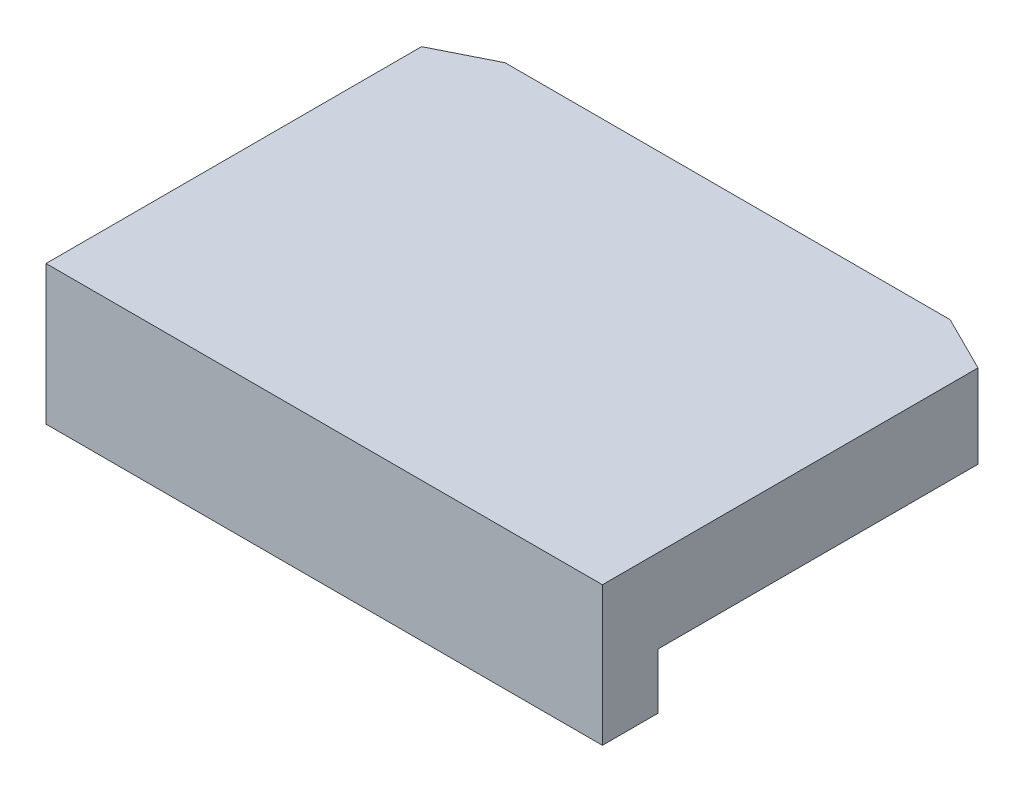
ISO-10303-21;
HEADER;
FILE_DESCRIPTION(('STEP AP214'),'2;1');
FILE_NAME('part.step','',(''),(''),'','','');
FILE_SCHEMA(('AUTOMOTIVE_DESIGN { 1 0 10303 214 1 1 1 1 }'));
ENDSEC;
DATA;
#1=APPLICATION_CONTEXT('core data for automotive mechanical design processes');
#2=APPLICATION_PROTOCOL_DEFINITION('international standard','automotive_design',2000,#1);
#3=PRODUCT_CONTEXT('',#1,'mechanical');
#4=PRODUCT('Part','Part','',(#3));
#5=PRODUCT_RELATED_PRODUCT_CATEGORY('part','',(#4));
#6=PRODUCT_DEFINITION_FORMATION('','',#4);
#7=PRODUCT_DEFINITION_CONTEXT('part definition',#1,'design');
#8=PRODUCT_DEFINITION('design','',#6,#7);
#9=PRODUCT_DEFINITION_SHAPE('','',#8);
#10=(LENGTH_UNIT() NAMED_UNIT(*) SI_UNIT(.MILLI.,.METRE.));
#11=(NAMED_UNIT(*) PLANE_ANGLE_UNIT() SI_UNIT($,.RADIAN.));
#12=(NAMED_UNIT(*) SI_UNIT($,.STERADIAN.) SOLID_ANGLE_UNIT());
#13=UNCERTAINTY_MEASURE_WITH_UNIT(LENGTH_MEASURE(1.E-05),#10,'distance_accuracy_value','');
#14=(GEOMETRIC_REPRESENTATION_CONTEXT(3) GLOBAL_UNCERTAINTY_ASSIGNED_CONTEXT((#13)) GLOBAL_UNIT_ASSIGNED_CONTEXT((#10,
#11,#12)) REPRESENTATION_CONTEXT('',''));
#15=CARTESIAN_POINT('',(0.,0.,0.));
#16=DIRECTION('',(0.,0.,1.));
#17=DIRECTION('',(1.,0.,0.));
#18=AXIS2_PLACEMENT_3D('',#15,#16,#17);
#19=CARTESIAN_POINT('',(0.,0.,14.5));
#20=DIRECTION('',(1.,0.,0.));
#21=DIRECTION('',(0.,0.,-1.));
#22=AXIS2_PLACEMENT_3D('',#19,#20,#21);
#23=PLANE('',#22);
#24=DIRECTION('',(0.,1.,0.));
#25=VECTOR('',#24,1.);
#26=CARTESIAN_POINT('',(-1.81898940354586E-12,-9.5,0.999999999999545));
#27=LINE('',#26,#25);
#28=CARTESIAN_POINT('',(-1.81898940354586E-12,2.00000000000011,0.999999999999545));
#29=VERTEX_POINT('',#28);
#30=CARTESIAN_POINT('',(-1.81898940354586E-12,5.,0.999999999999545));
#31=VERTEX_POINT('',#30);
#32=EDGE_CURVE('E141',#29,#31,#27,.T.);
#33=ORIENTED_EDGE('',*,*,#32,.F.);
#34=DIRECTION('',(0.,0.,-1.));
#35=VECTOR('',#34,1.);
#36=CARTESIAN_POINT('',(0.,2.00000000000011,12.5));
#37=LINE('',#36,#35);
#38=CARTESIAN_POINT('',(0.,2.00000000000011,12.5));
#39=VERTEX_POINT('',#38);
#40=EDGE_CURVE('E148',#39,#29,#37,.T.);
#41=ORIENTED_EDGE('',*,*,#40,.F.);
#42=DIRECTION('',(0.,1.,0.));
#43=VECTOR('',#42,1.);
#44=CARTESIAN_POINT('',(0.,1.13686837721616E-13,12.5));
#45=LINE('',#44,#43);
#46=CARTESIAN_POINT('',(0.,1.13624387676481E-13,12.5));
#47=VERTEX_POINT('',#46);
#48=EDGE_CURVE('E145',#47,#39,#45,.T.);
#49=ORIENTED_EDGE('',*,*,#48,.F.);
#50=DIRECTION('',(0.,0.,-1.));
#51=VECTOR('',#50,1.);
#52=CARTESIAN_POINT('',(0.,0.,14.5));
#53=LINE('',#52,#51);
#54=CARTESIAN_POINT('',(0.,0.,14.5));
#55=VERTEX_POINT('',#54);
#56=EDGE_CURVE('E124',#55,#47,#53,.T.);
#57=ORIENTED_EDGE('',*,*,#56,.F.);
#58=DIRECTION('',(0.,-1.,0.));
#59=VECTOR('',#58,1.);
#60=CARTESIAN_POINT('',(0.,0.,14.5));
#61=LINE('',#60,#59);
#62=CARTESIAN_POINT('',(0.,5.,14.5));
#63=VERTEX_POINT('',#62);
#64=EDGE_CURVE('E159',#63,#55,#61,.T.);
#65=ORIENTED_EDGE('',*,*,#64,.F.);
#66=DIRECTION('',(0.,0.,-1.));
#67=VECTOR('',#66,1.);
#68=CARTESIAN_POINT('',(0.,5.,14.5));
#69=LINE('',#68,#67);
#70=EDGE_CURVE('E121',#63,#31,#69,.T.);
#71=ORIENTED_EDGE('',*,*,#70,.T.);
#72=EDGE_LOOP('',(#33,#41,#49,#57,#65,#71));
#73=FACE_BOUND('',#72,.T.);
#74=ADVANCED_FACE('F34',(#73),#23,.F.);
#75=CARTESIAN_POINT('',(20.,0.,14.5));
#76=DIRECTION('',(-1.,0.,0.));
#77=DIRECTION('',(0.,0.,1.));
#78=AXIS2_PLACEMENT_3D('',#75,#76,#77);
#79=PLANE('',#78);
#80=DIRECTION('',(0.,1.,0.));
#81=VECTOR('',#80,1.);
#82=CARTESIAN_POINT('',(19.9999999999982,-9.5,0.999999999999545));
#83=LINE('',#82,#81);
#84=CARTESIAN_POINT('',(20.,2.00000000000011,0.999999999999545));
#85=VERTEX_POINT('',#84);
#86=CARTESIAN_POINT('',(19.9999999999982,5.,0.999999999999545));
#87=VERTEX_POINT('',#86);
#88=EDGE_CURVE('E55',#85,#87,#83,.T.);
#89=ORIENTED_EDGE('',*,*,#88,.T.);
#90=DIRECTION('',(0.,0.,-1.));
#91=VECTOR('',#90,1.);
#92=CARTESIAN_POINT('',(20.,5.,14.5));
#93=LINE('',#92,#91);
#94=CARTESIAN_POINT('',(20.,5.,14.5));
#95=VERTEX_POINT('',#94);
#96=EDGE_CURVE('E110',#95,#87,#93,.T.);
#97=ORIENTED_EDGE('',*,*,#96,.F.);
#98=DIRECTION('',(0.,1.,0.));
#99=VECTOR('',#98,1.);
#100=CARTESIAN_POINT('',(20.,0.,14.5));
#101=LINE('',#100,#99);
#102=CARTESIAN_POINT('',(20.,0.,14.5));
#103=VERTEX_POINT('',#102);
#104=EDGE_CURVE('E164',#103,#95,#101,.T.);
#105=ORIENTED_EDGE('',*,*,#104,.F.);
#106=DIRECTION('',(0.,0.,-1.));
#107=VECTOR('',#106,1.);
#108=CARTESIAN_POINT('',(20.,0.,14.5));
#109=LINE('',#108,#107);
#110=CARTESIAN_POINT('',(20.,1.13686837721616E-13,12.5));
#111=VERTEX_POINT('',#110);
#112=EDGE_CURVE('E120',#103,#111,#109,.T.);
#113=ORIENTED_EDGE('',*,*,#112,.T.);
#114=DIRECTION('',(0.,1.,0.));
#115=VECTOR('',#114,1.);
#116=CARTESIAN_POINT('',(20.,1.13686837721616E-13,12.5));
#117=LINE('',#116,#115);
#118=CARTESIAN_POINT('',(20.,2.00000000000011,12.5));
#119=VERTEX_POINT('',#118);
#120=EDGE_CURVE('E151',#111,#119,#117,.T.);
#121=ORIENTED_EDGE('',*,*,#120,.T.);
#122=DIRECTION('',(0.,0.,-1.));
#123=VECTOR('',#122,1.);
#124=CARTESIAN_POINT('',(20.,2.00000000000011,12.5));
#125=LINE('',#124,#123);
#126=EDGE_CURVE('E114',#119,#85,#125,.T.);
#127=ORIENTED_EDGE('',*,*,#126,.T.);
#128=EDGE_LOOP('',(#89,#97,#105,#113,#121,#127));
#129=FACE_BOUND('',#128,.T.);
#130=ADVANCED_FACE('F108',(#129),#79,.F.);
#131=CARTESIAN_POINT('',(0.,5.,0.));
#132=DIRECTION('',(0.,0.,-1.));
#133=DIRECTION('',(-1.,0.,0.));
#134=AXIS2_PLACEMENT_3D('',#131,#132,#133);
#135=PLANE('',#134);
#136=DIRECTION('',(1.,0.,0.));
#137=VECTOR('',#136,1.);
#138=CARTESIAN_POINT('',(0.,2.00000000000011,0.));
#139=LINE('',#138,#137);
#140=CARTESIAN_POINT('',(1.99999999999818,2.00000000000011,0.));
#141=VERTEX_POINT('',#140);
#142=CARTESIAN_POINT('',(17.9999999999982,2.00000000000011,-4.54747350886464E-13));
#143=VERTEX_POINT('',#142);
#144=EDGE_CURVE('E136',#141,#143,#139,.T.);
#145=ORIENTED_EDGE('',*,*,#144,.F.);
#146=DIRECTION('',(0.,1.,0.));
#147=VECTOR('',#146,1.);
#148=CARTESIAN_POINT('',(1.99999999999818,-9.5,-4.54747350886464E-13));
#149=LINE('',#148,#147);
#150=CARTESIAN_POINT('',(1.99999999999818,5.,-4.54747350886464E-13));
#151=VERTEX_POINT('',#150);
#152=EDGE_CURVE('E48',#141,#151,#149,.T.);
#153=ORIENTED_EDGE('',*,*,#152,.T.);
#154=DIRECTION('',(-1.,0.,0.));
#155=VECTOR('',#154,1.);
#156=CARTESIAN_POINT('',(0.,5.,0.));
#157=LINE('',#156,#155);
#158=CARTESIAN_POINT('',(17.9999999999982,5.,-4.54747350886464E-13));
#159=VERTEX_POINT('',#158);
#160=EDGE_CURVE('E139',#159,#151,#157,.T.);
#161=ORIENTED_EDGE('',*,*,#160,.F.);
#162=DIRECTION('',(0.,1.,0.));
#163=VECTOR('',#162,1.);
#164=CARTESIAN_POINT('',(17.9999999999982,-9.5,-4.54747350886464E-13));
#165=LINE('',#164,#163);
#166=EDGE_CURVE('E98',#143,#159,#165,.T.);
#167=ORIENTED_EDGE('',*,*,#166,.F.);
#168=EDGE_LOOP('',(#145,#153,#161,#167));
#169=FACE_BOUND('',#168,.T.);
#170=ADVANCED_FACE('F138',(#169),#135,.T.);
#171=CARTESIAN_POINT('',(0.,5.,14.5));
#172=DIRECTION('',(0.,-1.,0.));
#173=DIRECTION('',(0.,0.,-1.));
#174=AXIS2_PLACEMENT_3D('',#171,#172,#173);
#175=PLANE('',#174);
#176=DIRECTION('',(-0.894427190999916,0.,0.447213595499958));
#177=VECTOR('',#176,1.);
#178=CARTESIAN_POINT('',(1.99999999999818,5.,-4.54747350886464E-13));
#179=LINE('',#178,#177);
#180=EDGE_CURVE('E103',#151,#31,#179,.T.);
#181=ORIENTED_EDGE('',*,*,#180,.T.);
#182=ORIENTED_EDGE('',*,*,#70,.F.);
#183=DIRECTION('',(-1.,0.,0.));
#184=VECTOR('',#183,1.);
#185=CARTESIAN_POINT('',(0.,5.,14.5));
#186=LINE('',#185,#184);
#187=EDGE_CURVE('E119',#95,#63,#186,.T.);
#188=ORIENTED_EDGE('',*,*,#187,.F.);
#189=ORIENTED_EDGE('',*,*,#96,.T.);
#190=DIRECTION('',(-0.894427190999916,0.,-0.447213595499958));
#191=VECTOR('',#190,1.);
#192=CARTESIAN_POINT('',(17.9999999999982,5.,-4.54747350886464E-13));
#193=LINE('',#192,#191);
#194=EDGE_CURVE('E95',#87,#159,#193,.T.);
#195=ORIENTED_EDGE('',*,*,#194,.T.);
#196=ORIENTED_EDGE('',*,*,#160,.T.);
#197=EDGE_LOOP('',(#181,#182,#188,#189,#195,#196));
#198=FACE_BOUND('',#197,.T.);
#199=ADVANCED_FACE('F117',(#198),#175,.F.);
#200=CARTESIAN_POINT('',(0.,2.00000000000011,12.5));
#201=DIRECTION('',(0.,-1.,0.));
#202=DIRECTION('',(0.,0.,-1.));
#203=AXIS2_PLACEMENT_3D('',#200,#201,#202);
#204=PLANE('',#203);
#205=ORIENTED_EDGE('',*,*,#40,.T.);
#206=DIRECTION('',(0.894427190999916,0.,-0.447213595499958));
#207=VECTOR('',#206,1.);
#208=CARTESIAN_POINT('',(-4.60000000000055,2.00000000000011,3.29999999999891));
#209=LINE('',#208,#207);
#210=EDGE_CURVE('E12',#29,#141,#209,.T.);
#211=ORIENTED_EDGE('',*,*,#210,.T.);
#212=ORIENTED_EDGE('',*,*,#144,.T.);
#213=DIRECTION('',(0.894427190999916,0.,0.447213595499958));
#214=VECTOR('',#213,1.);
#215=CARTESIAN_POINT('',(8.59999999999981,2.00000000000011,-4.69999999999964));
#216=LINE('',#215,#214);
#217=EDGE_CURVE('E41',#143,#85,#216,.T.);
#218=ORIENTED_EDGE('',*,*,#217,.T.);
#219=ORIENTED_EDGE('',*,*,#126,.F.);
#220=DIRECTION('',(1.,0.,0.));
#221=VECTOR('',#220,1.);
#222=CARTESIAN_POINT('',(0.,2.00000000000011,12.5));
#223=LINE('',#222,#221);
#224=EDGE_CURVE('E155',#39,#119,#223,.T.);
#225=ORIENTED_EDGE('',*,*,#224,.F.);
#226=EDGE_LOOP('',(#205,#211,#212,#218,#219,#225));
#227=FACE_BOUND('',#226,.T.);
#228=ADVANCED_FACE('F134',(#227),#204,.T.);
#229=CARTESIAN_POINT('',(0.,0.,14.5));
#230=DIRECTION('',(0.,1.,0.));
#231=DIRECTION('',(0.,0.,1.));
#232=AXIS2_PLACEMENT_3D('',#229,#230,#231);
#233=PLANE('',#232);
#234=DIRECTION('',(1.,0.,0.));
#235=VECTOR('',#234,1.);
#236=CARTESIAN_POINT('',(0.,1.13686837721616E-13,12.5));
#237=LINE('',#236,#235);
#238=EDGE_CURVE('E150',#47,#111,#237,.T.);
#239=ORIENTED_EDGE('',*,*,#238,.T.);
#240=ORIENTED_EDGE('',*,*,#112,.F.);
#241=DIRECTION('',(1.,0.,0.));
#242=VECTOR('',#241,1.);
#243=CARTESIAN_POINT('',(0.,0.,14.5));
#244=LINE('',#243,#242);
#245=EDGE_CURVE('E162',#55,#103,#244,.T.);
#246=ORIENTED_EDGE('',*,*,#245,.F.);
#247=ORIENTED_EDGE('',*,*,#56,.T.);
#248=EDGE_LOOP('',(#239,#240,#246,#247));
#249=FACE_BOUND('',#248,.T.);
#250=ADVANCED_FACE('F177',(#249),#233,.F.);
#251=CARTESIAN_POINT('',(0.,5.,14.5));
#252=DIRECTION('',(0.,0.,-1.));
#253=DIRECTION('',(-1.,0.,0.));
#254=AXIS2_PLACEMENT_3D('',#251,#252,#253);
#255=PLANE('',#254);
#256=ORIENTED_EDGE('',*,*,#64,.T.);
#257=ORIENTED_EDGE('',*,*,#245,.T.);
#258=ORIENTED_EDGE('',*,*,#104,.T.);
#259=ORIENTED_EDGE('',*,*,#187,.T.);
#260=EDGE_LOOP('',(#256,#257,#258,#259));
#261=FACE_BOUND('',#260,.T.);
#262=ADVANCED_FACE('F174',(#261),#255,.F.);
#263=CARTESIAN_POINT('',(0.,1.13686837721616E-13,12.5));
#264=DIRECTION('',(0.,0.,-1.));
#265=DIRECTION('',(-1.,0.,0.));
#266=AXIS2_PLACEMENT_3D('',#263,#264,#265);
#267=PLANE('',#266);
#268=ORIENTED_EDGE('',*,*,#120,.F.);
#269=ORIENTED_EDGE('',*,*,#238,.F.);
#270=ORIENTED_EDGE('',*,*,#48,.T.);
#271=ORIENTED_EDGE('',*,*,#224,.T.);
#272=EDGE_LOOP('',(#268,#269,#270,#271));
#273=FACE_BOUND('',#272,.T.);
#274=ADVANCED_FACE('F179',(#273),#267,.T.);
#275=CARTESIAN_POINT('',(17.9999999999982,-9.5,-4.54747350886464E-13));
#276=DIRECTION('',(0.447213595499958,0.,-0.894427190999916));
#277=DIRECTION('',(-0.894427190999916,0.,-0.447213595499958));
#278=AXIS2_PLACEMENT_3D('',#275,#276,#277);
#279=PLANE('',#278);
#280=ORIENTED_EDGE('',*,*,#166,.T.);
#281=ORIENTED_EDGE('',*,*,#194,.F.);
#282=ORIENTED_EDGE('',*,*,#88,.F.);
#283=ORIENTED_EDGE('',*,*,#217,.F.);
#284=EDGE_LOOP('',(#280,#281,#282,#283));
#285=FACE_BOUND('',#284,.T.);
#286=ADVANCED_FACE('F96',(#285),#279,.T.);
#287=CARTESIAN_POINT('',(1.99999999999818,-9.5,-4.54747350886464E-13));
#288=DIRECTION('',(-0.447213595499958,0.,-0.894427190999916));
#289=DIRECTION('',(-0.894427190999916,0.,0.447213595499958));
#290=AXIS2_PLACEMENT_3D('',#287,#288,#289);
#291=PLANE('',#290);
#292=ORIENTED_EDGE('',*,*,#32,.T.);
#293=ORIENTED_EDGE('',*,*,#180,.F.);
#294=ORIENTED_EDGE('',*,*,#152,.F.);
#295=ORIENTED_EDGE('',*,*,#210,.F.);
#296=EDGE_LOOP('',(#292,#293,#294,#295));
#297=FACE_BOUND('',#296,.T.);
#298=ADVANCED_FACE('F180',(#297),#291,.T.);
#299=CLOSED_SHELL('',(#74,#130,#170,#199,#228,#250,#262,#274,#286,#298));
#300=MANIFOLD_SOLID_BREP('B2',#299);
#301=ADVANCED_BREP_SHAPE_REPRESENTATION('',(#18,#300),#14);
#302=SHAPE_DEFINITION_REPRESENTATION(#9,#301);
ENDSEC;
END-ISO-10303-21;
